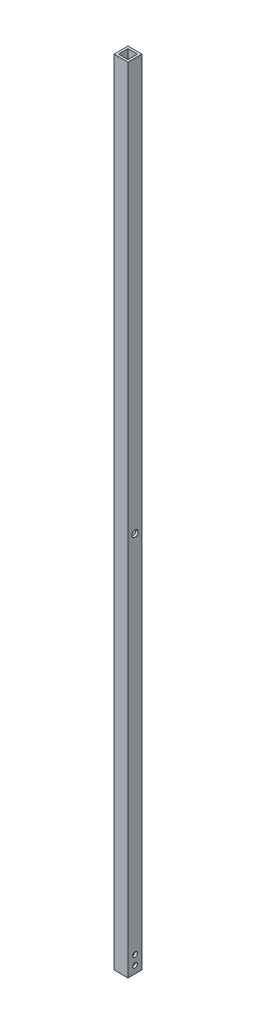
ISO-10303-21;
HEADER;
FILE_DESCRIPTION(('STEP AP214'),'2;1');
FILE_NAME('part.step','',(''),(''),'','','');
FILE_SCHEMA(('AUTOMOTIVE_DESIGN { 1 0 10303 214 1 1 1 1 }'));
ENDSEC;
DATA;
#1=APPLICATION_CONTEXT('core data for automotive mechanical design processes');
#2=APPLICATION_PROTOCOL_DEFINITION('international standard','automotive_design',2000,#1);
#3=PRODUCT_CONTEXT('',#1,'mechanical');
#4=PRODUCT('Part','Part','',(#3));
#5=PRODUCT_RELATED_PRODUCT_CATEGORY('part','',(#4));
#6=PRODUCT_DEFINITION_FORMATION('','',#4);
#7=PRODUCT_DEFINITION_CONTEXT('part definition',#1,'design');
#8=PRODUCT_DEFINITION('design','',#6,#7);
#9=PRODUCT_DEFINITION_SHAPE('','',#8);
#10=(LENGTH_UNIT() NAMED_UNIT(*) SI_UNIT(.MILLI.,.METRE.));
#11=(NAMED_UNIT(*) PLANE_ANGLE_UNIT() SI_UNIT($,.RADIAN.));
#12=(NAMED_UNIT(*) SI_UNIT($,.STERADIAN.) SOLID_ANGLE_UNIT());
#13=UNCERTAINTY_MEASURE_WITH_UNIT(LENGTH_MEASURE(1.E-05),#10,'distance_accuracy_value','');
#14=(GEOMETRIC_REPRESENTATION_CONTEXT(3) GLOBAL_UNCERTAINTY_ASSIGNED_CONTEXT((#13)) GLOBAL_UNIT_ASSIGNED_CONTEXT((#10,
#11,#12)) REPRESENTATION_CONTEXT('',''));
#15=CARTESIAN_POINT('',(0.,0.,0.));
#16=DIRECTION('',(0.,0.,1.));
#17=DIRECTION('',(1.,0.,0.));
#18=AXIS2_PLACEMENT_3D('',#15,#16,#17);
#19=CARTESIAN_POINT('',(-3.175,538.48,3.175));
#20=DIRECTION('',(1.,0.,0.));
#21=DIRECTION('',(0.,0.,-1.));
#22=AXIS2_PLACEMENT_3D('',#19,#20,#21);
#23=PLANE('',#22);
#24=CARTESIAN_POINT('',(-3.175,258.92125,0.));
#25=DIRECTION('',(1.,0.,0.));
#26=DIRECTION('',(0.,0.,-1.));
#27=AXIS2_PLACEMENT_3D('',#24,#25,#26);
#28=CIRCLE('',#27,3.17499999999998);
#29=CARTESIAN_POINT('',(-3.175,258.92125,-3.175));
#30=VERTEX_POINT('',#29);
#31=CARTESIAN_POINT('',(-3.175,258.92125,3.175));
#32=VERTEX_POINT('',#31);
#33=EDGE_CURVE('E11',#30,#32,#28,.T.);
#34=ORIENTED_EDGE('',*,*,#33,.F.);
#35=DIRECTION('',(0.,-1.,0.));
#36=VECTOR('',#35,1.);
#37=CARTESIAN_POINT('',(-3.175,538.48,-3.175));
#38=LINE('',#37,#36);
#39=CARTESIAN_POINT('',(-3.175,538.48,-3.175));
#40=VERTEX_POINT('',#39);
#41=EDGE_CURVE('E62',#40,#30,#38,.T.);
#42=ORIENTED_EDGE('',*,*,#41,.F.);
#43=DIRECTION('',(0.,0.,1.));
#44=VECTOR('',#43,1.);
#45=CARTESIAN_POINT('',(-3.175,538.48,3.175));
#46=LINE('',#45,#44);
#47=CARTESIAN_POINT('',(-3.175,538.48,3.175));
#48=VERTEX_POINT('',#47);
#49=EDGE_CURVE('E219',#40,#48,#46,.T.);
#50=ORIENTED_EDGE('',*,*,#49,.T.);
#51=DIRECTION('',(0.,-1.,0.));
#52=VECTOR('',#51,1.);
#53=CARTESIAN_POINT('',(-3.175,538.48,3.175));
#54=LINE('',#53,#52);
#55=EDGE_CURVE('E119',#48,#32,#54,.T.);
#56=ORIENTED_EDGE('',*,*,#55,.T.);
#57=EDGE_LOOP('',(#34,#42,#50,#56));
#58=FACE_BOUND('',#57,.T.);
#59=ADVANCED_FACE('F39',(#58),#23,.T.);
#60=CARTESIAN_POINT('',(0.,538.48,0.));
#61=DIRECTION('',(0.,-1.,0.));
#62=DIRECTION('',(0.,0.,-1.));
#63=AXIS2_PLACEMENT_3D('',#60,#61,#62);
#64=PLANE('',#63);
#65=DIRECTION('',(0.,0.,-1.));
#66=VECTOR('',#65,1.);
#67=CARTESIAN_POINT('',(4.7625,538.48,4.7625));
#68=LINE('',#67,#66);
#69=CARTESIAN_POINT('',(4.7625,538.48,4.7625));
#70=VERTEX_POINT('',#69);
#71=CARTESIAN_POINT('',(4.7625,538.48,-4.7625));
#72=VERTEX_POINT('',#71);
#73=EDGE_CURVE('E150',#70,#72,#68,.T.);
#74=ORIENTED_EDGE('',*,*,#73,.T.);
#75=DIRECTION('',(-1.,0.,0.));
#76=VECTOR('',#75,1.);
#77=CARTESIAN_POINT('',(-4.7625,538.48,-4.7625));
#78=LINE('',#77,#76);
#79=CARTESIAN_POINT('',(-4.7625,538.48,-4.7625));
#80=VERTEX_POINT('',#79);
#81=EDGE_CURVE('E154',#72,#80,#78,.T.);
#82=ORIENTED_EDGE('',*,*,#81,.T.);
#83=DIRECTION('',(0.,0.,1.));
#84=VECTOR('',#83,1.);
#85=CARTESIAN_POINT('',(-4.7625,538.48,4.7625));
#86=LINE('',#85,#84);
#87=CARTESIAN_POINT('',(-4.7625,538.48,4.7625));
#88=VERTEX_POINT('',#87);
#89=EDGE_CURVE('E157',#80,#88,#86,.T.);
#90=ORIENTED_EDGE('',*,*,#89,.T.);
#91=DIRECTION('',(1.,0.,0.));
#92=VECTOR('',#91,1.);
#93=CARTESIAN_POINT('',(-4.7625,538.48,4.7625));
#94=LINE('',#93,#92);
#95=EDGE_CURVE('E159',#88,#70,#94,.T.);
#96=ORIENTED_EDGE('',*,*,#95,.T.);
#97=EDGE_LOOP('',(#74,#82,#90,#96));
#98=FACE_BOUND('',#97,.T.);
#99=DIRECTION('',(1.,0.,0.));
#100=VECTOR('',#99,1.);
#101=CARTESIAN_POINT('',(-3.175,538.48,3.175));
#102=LINE('',#101,#100);
#103=CARTESIAN_POINT('',(3.175,538.48,3.175));
#104=VERTEX_POINT('',#103);
#105=EDGE_CURVE('E213',#48,#104,#102,.T.);
#106=ORIENTED_EDGE('',*,*,#105,.F.);
#107=ORIENTED_EDGE('',*,*,#49,.F.);
#108=DIRECTION('',(-1.,0.,0.));
#109=VECTOR('',#108,1.);
#110=CARTESIAN_POINT('',(-3.175,538.48,-3.175));
#111=LINE('',#110,#109);
#112=CARTESIAN_POINT('',(3.175,538.48,-3.175));
#113=VERTEX_POINT('',#112);
#114=EDGE_CURVE('E134',#113,#40,#111,.T.);
#115=ORIENTED_EDGE('',*,*,#114,.F.);
#116=DIRECTION('',(0.,0.,-1.));
#117=VECTOR('',#116,1.);
#118=CARTESIAN_POINT('',(3.175,538.48,3.175));
#119=LINE('',#118,#117);
#120=EDGE_CURVE('E215',#104,#113,#119,.T.);
#121=ORIENTED_EDGE('',*,*,#120,.F.);
#122=EDGE_LOOP('',(#106,#107,#115,#121));
#123=FACE_BOUND('',#122,.T.);
#124=ADVANCED_FACE('F235',(#98,#123),#64,.F.);
#125=CARTESIAN_POINT('',(0.,0.,0.));
#126=DIRECTION('',(0.,-1.,0.));
#127=DIRECTION('',(0.,0.,-1.));
#128=AXIS2_PLACEMENT_3D('',#125,#126,#127);
#129=PLANE('',#128);
#130=DIRECTION('',(0.,0.,-1.));
#131=VECTOR('',#130,1.);
#132=CARTESIAN_POINT('',(4.7625,0.,4.7625));
#133=LINE('',#132,#131);
#134=CARTESIAN_POINT('',(4.7625,0.,4.7625));
#135=VERTEX_POINT('',#134);
#136=CARTESIAN_POINT('',(4.7625,0.,-4.7625));
#137=VERTEX_POINT('',#136);
#138=EDGE_CURVE('E149',#135,#137,#133,.T.);
#139=ORIENTED_EDGE('',*,*,#138,.F.);
#140=DIRECTION('',(1.,0.,0.));
#141=VECTOR('',#140,1.);
#142=CARTESIAN_POINT('',(-4.7625,0.,4.7625));
#143=LINE('',#142,#141);
#144=CARTESIAN_POINT('',(-4.7625,0.,4.7625));
#145=VERTEX_POINT('',#144);
#146=EDGE_CURVE('E155',#145,#135,#143,.T.);
#147=ORIENTED_EDGE('',*,*,#146,.F.);
#148=DIRECTION('',(0.,0.,1.));
#149=VECTOR('',#148,1.);
#150=CARTESIAN_POINT('',(-4.7625,0.,4.7625));
#151=LINE('',#150,#149);
#152=CARTESIAN_POINT('',(-4.7625,0.,-4.7625));
#153=VERTEX_POINT('',#152);
#154=EDGE_CURVE('E166',#153,#145,#151,.T.);
#155=ORIENTED_EDGE('',*,*,#154,.F.);
#156=DIRECTION('',(-1.,0.,0.));
#157=VECTOR('',#156,1.);
#158=CARTESIAN_POINT('',(-4.7625,0.,-4.7625));
#159=LINE('',#158,#157);
#160=EDGE_CURVE('E164',#137,#153,#159,.T.);
#161=ORIENTED_EDGE('',*,*,#160,.F.);
#162=EDGE_LOOP('',(#139,#147,#155,#161));
#163=FACE_BOUND('',#162,.T.);
#164=DIRECTION('',(0.,0.,1.));
#165=VECTOR('',#164,1.);
#166=CARTESIAN_POINT('',(-3.175,0.,3.175));
#167=LINE('',#166,#165);
#168=CARTESIAN_POINT('',(-3.175,0.,-3.175));
#169=VERTEX_POINT('',#168);
#170=CARTESIAN_POINT('',(-3.175,0.,3.175));
#171=VERTEX_POINT('',#170);
#172=EDGE_CURVE('E125',#169,#171,#167,.T.);
#173=ORIENTED_EDGE('',*,*,#172,.T.);
#174=DIRECTION('',(1.,0.,0.));
#175=VECTOR('',#174,1.);
#176=CARTESIAN_POINT('',(-3.175,0.,3.175));
#177=LINE('',#176,#175);
#178=CARTESIAN_POINT('',(3.175,0.,3.175));
#179=VERTEX_POINT('',#178);
#180=EDGE_CURVE('E212',#171,#179,#177,.T.);
#181=ORIENTED_EDGE('',*,*,#180,.T.);
#182=DIRECTION('',(0.,0.,-1.));
#183=VECTOR('',#182,1.);
#184=CARTESIAN_POINT('',(3.175,0.,3.175));
#185=LINE('',#184,#183);
#186=CARTESIAN_POINT('',(3.175,0.,-3.175));
#187=VERTEX_POINT('',#186);
#188=EDGE_CURVE('E224',#179,#187,#185,.T.);
#189=ORIENTED_EDGE('',*,*,#188,.T.);
#190=DIRECTION('',(-1.,0.,0.));
#191=VECTOR('',#190,1.);
#192=CARTESIAN_POINT('',(-3.175,0.,-3.175));
#193=LINE('',#192,#191);
#194=EDGE_CURVE('E227',#187,#169,#193,.T.);
#195=ORIENTED_EDGE('',*,*,#194,.T.);
#196=EDGE_LOOP('',(#173,#181,#189,#195));
#197=FACE_BOUND('',#196,.T.);
#198=ADVANCED_FACE('F229',(#163,#197),#129,.T.);
#199=CARTESIAN_POINT('',(4.7625,538.48,4.7625));
#200=DIRECTION('',(-1.,0.,0.));
#201=DIRECTION('',(0.,0.,1.));
#202=AXIS2_PLACEMENT_3D('',#199,#200,#201);
#203=PLANE('',#202);
#204=CARTESIAN_POINT('',(4.7625,258.92125,0.));
#205=DIRECTION('',(-1.,0.,0.));
#206=DIRECTION('',(0.,0.,1.));
#207=AXIS2_PLACEMENT_3D('',#204,#205,#206);
#208=CIRCLE('',#207,2.15264999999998);
#209=CARTESIAN_POINT('',(4.7625,258.92125,2.15265000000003));
#210=VERTEX_POINT('',#209);
#211=EDGE_CURVE('E406',#210,#210,#208,.T.);
#212=ORIENTED_EDGE('',*,*,#211,.T.);
#213=EDGE_LOOP('',(#212));
#214=FACE_BOUND('',#213,.T.);
#215=CARTESIAN_POINT('',(4.7625,5.08,8.48231628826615E-13));
#216=DIRECTION('',(-1.,0.,0.));
#217=DIRECTION('',(0.,0.,1.));
#218=AXIS2_PLACEMENT_3D('',#215,#216,#217);
#219=CIRCLE('',#218,1.5875);
#220=CARTESIAN_POINT('',(4.7625,5.08,1.58750000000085));
#221=VERTEX_POINT('',#220);
#222=EDGE_CURVE('E190',#221,#221,#219,.T.);
#223=ORIENTED_EDGE('',*,*,#222,.T.);
#224=EDGE_LOOP('',(#223));
#225=FACE_BOUND('',#224,.T.);
#226=CARTESIAN_POINT('',(4.7625,11.43,8.4781162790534E-13));
#227=DIRECTION('',(-1.,0.,0.));
#228=DIRECTION('',(0.,0.,1.));
#229=AXIS2_PLACEMENT_3D('',#226,#227,#228);
#230=CIRCLE('',#229,1.5875);
#231=CARTESIAN_POINT('',(4.7625,11.43,1.58750000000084));
#232=VERTEX_POINT('',#231);
#233=EDGE_CURVE('E186',#232,#232,#230,.T.);
#234=ORIENTED_EDGE('',*,*,#233,.T.);
#235=EDGE_LOOP('',(#234));
#236=FACE_BOUND('',#235,.T.);
#237=ORIENTED_EDGE('',*,*,#138,.T.);
#238=DIRECTION('',(0.,-1.,0.));
#239=VECTOR('',#238,1.);
#240=CARTESIAN_POINT('',(4.7625,538.48,-4.7625));
#241=LINE('',#240,#239);
#242=EDGE_CURVE('E116',#72,#137,#241,.T.);
#243=ORIENTED_EDGE('',*,*,#242,.F.);
#244=ORIENTED_EDGE('',*,*,#73,.F.);
#245=DIRECTION('',(0.,-1.,0.));
#246=VECTOR('',#245,1.);
#247=CARTESIAN_POINT('',(4.7625,538.48,4.7625));
#248=LINE('',#247,#246);
#249=EDGE_CURVE('E161',#70,#135,#248,.T.);
#250=ORIENTED_EDGE('',*,*,#249,.T.);
#251=EDGE_LOOP('',(#237,#243,#244,#250));
#252=FACE_BOUND('',#251,.T.);
#253=ADVANCED_FACE('F41',(#214,#225,#236,#252),#203,.F.);
#254=CARTESIAN_POINT('',(-4.7625,538.48,-4.7625));
#255=DIRECTION('',(0.,0.,1.));
#256=DIRECTION('',(1.,0.,0.));
#257=AXIS2_PLACEMENT_3D('',#254,#255,#256);
#258=PLANE('',#257);
#259=ORIENTED_EDGE('',*,*,#160,.T.);
#260=DIRECTION('',(0.,-1.,0.));
#261=VECTOR('',#260,1.);
#262=CARTESIAN_POINT('',(-4.7625,538.48,-4.7625));
#263=LINE('',#262,#261);
#264=EDGE_CURVE('E176',#80,#153,#263,.T.);
#265=ORIENTED_EDGE('',*,*,#264,.F.);
#266=ORIENTED_EDGE('',*,*,#81,.F.);
#267=ORIENTED_EDGE('',*,*,#242,.T.);
#268=EDGE_LOOP('',(#259,#265,#266,#267));
#269=FACE_BOUND('',#268,.T.);
#270=ADVANCED_FACE('F329',(#269),#258,.F.);
#271=CARTESIAN_POINT('',(-4.7625,538.48,4.7625));
#272=DIRECTION('',(1.,0.,0.));
#273=DIRECTION('',(0.,0.,-1.));
#274=AXIS2_PLACEMENT_3D('',#271,#272,#273);
#275=PLANE('',#274);
#276=CARTESIAN_POINT('',(-4.7625,258.92125,0.));
#277=DIRECTION('',(-1.,0.,0.));
#278=DIRECTION('',(0.,0.,1.));
#279=AXIS2_PLACEMENT_3D('',#276,#277,#278);
#280=CIRCLE('',#279,3.17499999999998);
#281=CARTESIAN_POINT('',(-4.7625,258.92125,3.17500000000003));
#282=VERTEX_POINT('',#281);
#283=EDGE_CURVE('E388',#282,#282,#280,.T.);
#284=ORIENTED_EDGE('',*,*,#283,.F.);
#285=EDGE_LOOP('',(#284));
#286=FACE_BOUND('',#285,.T.);
#287=CARTESIAN_POINT('',(-4.7625,5.08,8.48231628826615E-13));
#288=DIRECTION('',(-1.,0.,0.));
#289=DIRECTION('',(0.,0.,1.));
#290=AXIS2_PLACEMENT_3D('',#287,#288,#289);
#291=CIRCLE('',#290,1.58749999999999);
#292=CARTESIAN_POINT('',(-4.7625,5.08,1.58750000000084));
#293=VERTEX_POINT('',#292);
#294=EDGE_CURVE('E197',#293,#293,#291,.T.);
#295=ORIENTED_EDGE('',*,*,#294,.F.);
#296=EDGE_LOOP('',(#295));
#297=FACE_BOUND('',#296,.T.);
#298=CARTESIAN_POINT('',(-4.7625,11.43,8.4781162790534E-13));
#299=DIRECTION('',(-1.,0.,0.));
#300=DIRECTION('',(0.,0.,1.));
#301=AXIS2_PLACEMENT_3D('',#298,#299,#300);
#302=CIRCLE('',#301,1.58749999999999);
#303=CARTESIAN_POINT('',(-4.7625,11.43,1.58750000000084));
#304=VERTEX_POINT('',#303);
#305=EDGE_CURVE('E194',#304,#304,#302,.T.);
#306=ORIENTED_EDGE('',*,*,#305,.F.);
#307=EDGE_LOOP('',(#306));
#308=FACE_BOUND('',#307,.T.);
#309=ORIENTED_EDGE('',*,*,#154,.T.);
#310=DIRECTION('',(0.,-1.,0.));
#311=VECTOR('',#310,1.);
#312=CARTESIAN_POINT('',(-4.7625,538.48,4.7625));
#313=LINE('',#312,#311);
#314=EDGE_CURVE('E172',#88,#145,#313,.T.);
#315=ORIENTED_EDGE('',*,*,#314,.F.);
#316=ORIENTED_EDGE('',*,*,#89,.F.);
#317=ORIENTED_EDGE('',*,*,#264,.T.);
#318=EDGE_LOOP('',(#309,#315,#316,#317));
#319=FACE_BOUND('',#318,.T.);
#320=ADVANCED_FACE('F321',(#286,#297,#308,#319),#275,.F.);
#321=CARTESIAN_POINT('',(-4.7625,538.48,4.7625));
#322=DIRECTION('',(0.,0.,-1.));
#323=DIRECTION('',(-1.,0.,0.));
#324=AXIS2_PLACEMENT_3D('',#321,#322,#323);
#325=PLANE('',#324);
#326=ORIENTED_EDGE('',*,*,#146,.T.);
#327=ORIENTED_EDGE('',*,*,#249,.F.);
#328=ORIENTED_EDGE('',*,*,#95,.F.);
#329=ORIENTED_EDGE('',*,*,#314,.T.);
#330=EDGE_LOOP('',(#326,#327,#328,#329));
#331=FACE_BOUND('',#330,.T.);
#332=ADVANCED_FACE('F250',(#331),#325,.F.);
#333=CARTESIAN_POINT('',(-3.175,538.48,3.175));
#334=DIRECTION('',(0.,0.,-1.));
#335=DIRECTION('',(-1.,0.,0.));
#336=AXIS2_PLACEMENT_3D('',#333,#334,#335);
#337=PLANE('',#336);
#338=EDGE_CURVE('E221',#32,#171,#54,.T.);
#339=ORIENTED_EDGE('',*,*,#338,.F.);
#340=ORIENTED_EDGE('',*,*,#55,.F.);
#341=ORIENTED_EDGE('',*,*,#105,.T.);
#342=DIRECTION('',(0.,-1.,0.));
#343=VECTOR('',#342,1.);
#344=CARTESIAN_POINT('',(3.175,538.48,3.175));
#345=LINE('',#344,#343);
#346=EDGE_CURVE('E141',#104,#179,#345,.T.);
#347=ORIENTED_EDGE('',*,*,#346,.T.);
#348=ORIENTED_EDGE('',*,*,#180,.F.);
#349=EDGE_LOOP('',(#339,#340,#341,#347,#348));
#350=FACE_BOUND('',#349,.T.);
#351=ADVANCED_FACE('F237',(#350),#337,.T.);
#352=CARTESIAN_POINT('',(3.175,538.48,3.175));
#353=DIRECTION('',(-1.,0.,0.));
#354=DIRECTION('',(0.,0.,1.));
#355=AXIS2_PLACEMENT_3D('',#352,#353,#354);
#356=PLANE('',#355);
#357=CARTESIAN_POINT('',(3.175,258.92125,0.));
#358=DIRECTION('',(-1.,0.,0.));
#359=DIRECTION('',(0.,0.,1.));
#360=AXIS2_PLACEMENT_3D('',#357,#358,#359);
#361=CIRCLE('',#360,2.15264999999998);
#362=CARTESIAN_POINT('',(3.175,258.92125,2.15265000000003));
#363=VERTEX_POINT('',#362);
#364=EDGE_CURVE('E202',#363,#363,#361,.T.);
#365=ORIENTED_EDGE('',*,*,#364,.F.);
#366=EDGE_LOOP('',(#365));
#367=FACE_BOUND('',#366,.T.);
#368=CARTESIAN_POINT('',(3.175,5.08,8.48231628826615E-13));
#369=DIRECTION('',(-1.,0.,0.));
#370=DIRECTION('',(0.,0.,1.));
#371=AXIS2_PLACEMENT_3D('',#368,#369,#370);
#372=CIRCLE('',#371,1.58749999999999);
#373=CARTESIAN_POINT('',(3.175,5.08,1.58750000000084));
#374=VERTEX_POINT('',#373);
#375=EDGE_CURVE('E189',#374,#374,#372,.T.);
#376=ORIENTED_EDGE('',*,*,#375,.F.);
#377=EDGE_LOOP('',(#376));
#378=FACE_BOUND('',#377,.T.);
#379=CARTESIAN_POINT('',(3.175,11.43,8.4781162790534E-13));
#380=DIRECTION('',(-1.,0.,0.));
#381=DIRECTION('',(0.,0.,1.));
#382=AXIS2_PLACEMENT_3D('',#379,#380,#381);
#383=CIRCLE('',#382,1.58749999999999);
#384=CARTESIAN_POINT('',(3.175,11.43,1.58750000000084));
#385=VERTEX_POINT('',#384);
#386=EDGE_CURVE('E185',#385,#385,#383,.T.);
#387=ORIENTED_EDGE('',*,*,#386,.F.);
#388=EDGE_LOOP('',(#387));
#389=FACE_BOUND('',#388,.T.);
#390=ORIENTED_EDGE('',*,*,#188,.F.);
#391=ORIENTED_EDGE('',*,*,#346,.F.);
#392=ORIENTED_EDGE('',*,*,#120,.T.);
#393=DIRECTION('',(0.,-1.,0.));
#394=VECTOR('',#393,1.);
#395=CARTESIAN_POINT('',(3.175,538.48,-3.175));
#396=LINE('',#395,#394);
#397=EDGE_CURVE('E137',#113,#187,#396,.T.);
#398=ORIENTED_EDGE('',*,*,#397,.T.);
#399=EDGE_LOOP('',(#390,#391,#392,#398));
#400=FACE_BOUND('',#399,.T.);
#401=ADVANCED_FACE('F241',(#367,#378,#389,#400),#356,.T.);
#402=CARTESIAN_POINT('',(-3.175,538.48,-3.175));
#403=DIRECTION('',(0.,0.,1.));
#404=DIRECTION('',(1.,0.,0.));
#405=AXIS2_PLACEMENT_3D('',#402,#403,#404);
#406=PLANE('',#405);
#407=ORIENTED_EDGE('',*,*,#41,.T.);
#408=EDGE_CURVE('E121',#30,#169,#38,.T.);
#409=ORIENTED_EDGE('',*,*,#408,.T.);
#410=ORIENTED_EDGE('',*,*,#194,.F.);
#411=ORIENTED_EDGE('',*,*,#397,.F.);
#412=ORIENTED_EDGE('',*,*,#114,.T.);
#413=EDGE_LOOP('',(#407,#409,#410,#411,#412));
#414=FACE_BOUND('',#413,.T.);
#415=ADVANCED_FACE('F131',(#414),#406,.T.);
#416=EDGE_CURVE('E43',#32,#30,#28,.T.);
#417=ORIENTED_EDGE('',*,*,#416,.F.);
#418=ORIENTED_EDGE('',*,*,#338,.T.);
#419=ORIENTED_EDGE('',*,*,#172,.F.);
#420=ORIENTED_EDGE('',*,*,#408,.F.);
#421=EDGE_LOOP('',(#417,#418,#419,#420));
#422=FACE_BOUND('',#421,.T.);
#423=CARTESIAN_POINT('',(-3.175,5.08,8.48231628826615E-13));
#424=DIRECTION('',(1.,0.,0.));
#425=DIRECTION('',(0.,0.,-1.));
#426=AXIS2_PLACEMENT_3D('',#423,#424,#425);
#427=CIRCLE('',#426,1.58749999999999);
#428=CARTESIAN_POINT('',(-3.175,5.08,-1.58749999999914));
#429=VERTEX_POINT('',#428);
#430=EDGE_CURVE('E187',#429,#429,#427,.T.);
#431=ORIENTED_EDGE('',*,*,#430,.F.);
#432=EDGE_LOOP('',(#431));
#433=FACE_BOUND('',#432,.T.);
#434=CARTESIAN_POINT('',(-3.175,11.43,8.4781162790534E-13));
#435=DIRECTION('',(1.,0.,0.));
#436=DIRECTION('',(0.,0.,-1.));
#437=AXIS2_PLACEMENT_3D('',#434,#435,#436);
#438=CIRCLE('',#437,1.58749999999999);
#439=CARTESIAN_POINT('',(-3.175,11.43,-1.58749999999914));
#440=VERTEX_POINT('',#439);
#441=EDGE_CURVE('E183',#440,#440,#438,.T.);
#442=ORIENTED_EDGE('',*,*,#441,.F.);
#443=EDGE_LOOP('',(#442));
#444=FACE_BOUND('',#443,.T.);
#445=ADVANCED_FACE('F122',(#422,#433,#444),#23,.T.);
#446=CARTESIAN_POINT('',(-4.7625,11.43,8.4781162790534E-13));
#447=DIRECTION('',(-1.,0.,0.));
#448=DIRECTION('',(0.,0.,1.));
#449=AXIS2_PLACEMENT_3D('',#446,#447,#448);
#450=CYLINDRICAL_SURFACE('',#449,1.58749999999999);
#451=ORIENTED_EDGE('',*,*,#441,.T.);
#452=EDGE_LOOP('',(#451));
#453=FACE_BOUND('',#452,.T.);
#454=ORIENTED_EDGE('',*,*,#305,.T.);
#455=EDGE_LOOP('',(#454));
#456=FACE_BOUND('',#455,.T.);
#457=ADVANCED_FACE('F263',(#453,#456),#450,.F.);
#458=ORIENTED_EDGE('',*,*,#386,.T.);
#459=EDGE_LOOP('',(#458));
#460=FACE_BOUND('',#459,.T.);
#461=ORIENTED_EDGE('',*,*,#233,.F.);
#462=EDGE_LOOP('',(#461));
#463=FACE_BOUND('',#462,.T.);
#464=ADVANCED_FACE('F267',(#460,#463),#450,.F.);
#465=CARTESIAN_POINT('',(-4.7625,5.08,8.48231628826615E-13));
#466=DIRECTION('',(-1.,0.,0.));
#467=DIRECTION('',(0.,0.,1.));
#468=AXIS2_PLACEMENT_3D('',#465,#466,#467);
#469=CYLINDRICAL_SURFACE('',#468,1.58749999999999);
#470=ORIENTED_EDGE('',*,*,#430,.T.);
#471=EDGE_LOOP('',(#470));
#472=FACE_BOUND('',#471,.T.);
#473=ORIENTED_EDGE('',*,*,#294,.T.);
#474=EDGE_LOOP('',(#473));
#475=FACE_BOUND('',#474,.T.);
#476=ADVANCED_FACE('F272',(#472,#475),#469,.F.);
#477=ORIENTED_EDGE('',*,*,#375,.T.);
#478=EDGE_LOOP('',(#477));
#479=FACE_BOUND('',#478,.T.);
#480=ORIENTED_EDGE('',*,*,#222,.F.);
#481=EDGE_LOOP('',(#480));
#482=FACE_BOUND('',#481,.T.);
#483=ADVANCED_FACE('F278',(#479,#482),#469,.F.);
#484=CARTESIAN_POINT('',(-4.7625,258.92125,0.));
#485=DIRECTION('',(-1.,0.,0.));
#486=DIRECTION('',(0.,0.,1.));
#487=AXIS2_PLACEMENT_3D('',#484,#485,#486);
#488=CYLINDRICAL_SURFACE('',#487,2.15264999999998);
#489=ORIENTED_EDGE('',*,*,#364,.T.);
#490=EDGE_LOOP('',(#489));
#491=FACE_BOUND('',#490,.T.);
#492=ORIENTED_EDGE('',*,*,#211,.F.);
#493=EDGE_LOOP('',(#492));
#494=FACE_BOUND('',#493,.T.);
#495=ADVANCED_FACE('F279',(#491,#494),#488,.F.);
#496=CARTESIAN_POINT('',(-4.7625,258.92125,0.));
#497=DIRECTION('',(-1.,0.,0.));
#498=DIRECTION('',(0.,0.,1.));
#499=AXIS2_PLACEMENT_3D('',#496,#497,#498);
#500=CYLINDRICAL_SURFACE('',#499,3.17499999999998);
#501=ORIENTED_EDGE('',*,*,#33,.T.);
#502=ORIENTED_EDGE('',*,*,#416,.T.);
#503=EDGE_LOOP('',(#501,#502));
#504=FACE_BOUND('',#503,.T.);
#505=ORIENTED_EDGE('',*,*,#283,.T.);
#506=EDGE_LOOP('',(#505));
#507=FACE_BOUND('',#506,.T.);
#508=ADVANCED_FACE('F110',(#504,#507),#500,.F.);
#509=CLOSED_SHELL('',(#59,#124,#198,#253,#270,#320,#332,#351,#401,#415,#445,#457,#464,#476,#483,
#495,#508));
#510=MANIFOLD_SOLID_BREP('B2',#509);
#511=ADVANCED_BREP_SHAPE_REPRESENTATION('',(#18,#510),#14);
#512=SHAPE_DEFINITION_REPRESENTATION(#9,#511);
ENDSEC;
END-ISO-10303-21;
